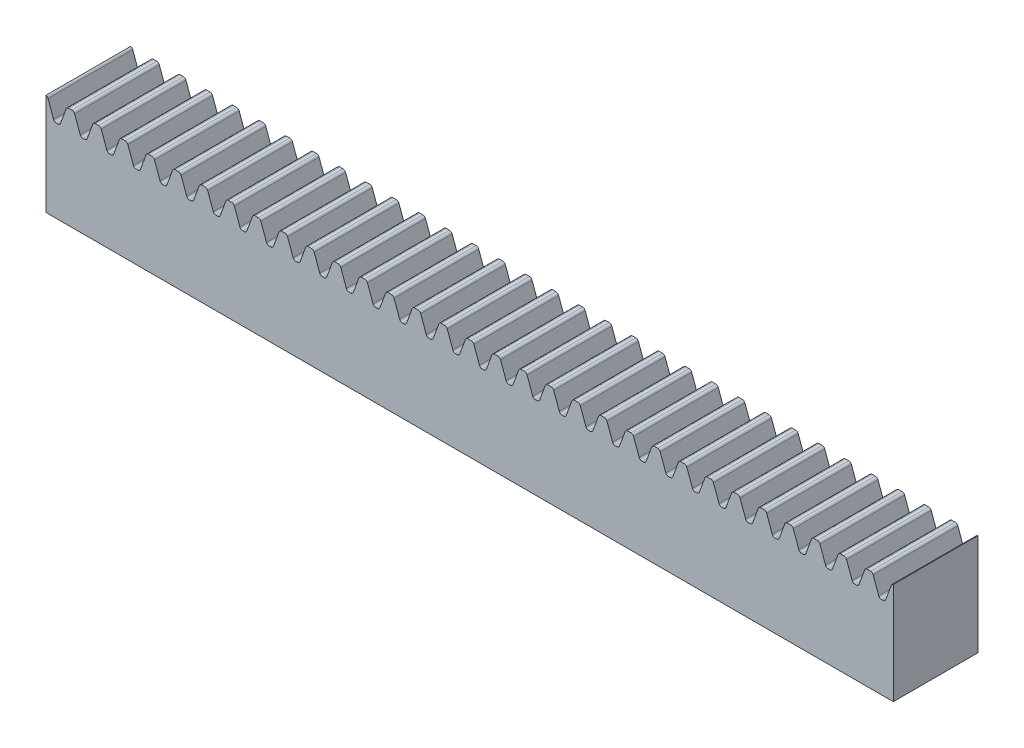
from build123d import *

# Parameters (mm, degrees)
BOSS_EXTRUDE1_DEPTH      = 5
BOSS_EXTRUDE1_DEPTH_BACK = 5
SKETCH3_W                = 100
SKETCH3_H                = 12
CUT_EXTRUDE1_DEPTH       = 51.606323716
LPATTERN1_COUNT          = 32
LPATTERN1_PITCH          = 3.141592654
LPATTERN1_COL_COUNT      = 2
LPATTERN1_COL_PITCH      = 3.141592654


with BuildPart() as part:
    # Sketch3 → Boss-Extrude1 (new, two sides: drawn at the far end of the back side and taken through both)
    with BuildSketch(Plane.XY.offset(-BOSS_EXTRUDE1_DEPTH_BACK)):
        Rectangle(SKETCH3_W, SKETCH3_H)
    extrude(amount=BOSS_EXTRUDE1_DEPTH + BOSS_EXTRUDE1_DEPTH_BACK)

    # Sketch4 → Cut-Extrude1 (cut, symmetric)
    with BuildSketch(Plane.XY):
        with BuildLine():
            Line((-47.625666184, 5.779244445), (-47.545317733, 6))
            Line((-47.545317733, 6), (-48.694686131, 6))
            Line((-48.694686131, 6), (-48.694686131, 3.75))
            Line((-48.694686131, 3.75), (-48.599173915, 3.75))
            ThreePointArc((-48.599173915, 3.75), (-48.406736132, 3.8106754), (-48.283902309, 3.970755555))
            Line((-48.283902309, 3.970755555), (-47.625666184, 5.779244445))
        make_face()
        with BuildLine():
            Line((-47.310394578, 6), (-47.545317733, 6))
            Line((-47.545317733, 6), (-47.625666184, 5.779244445))
            ThreePointArc((-47.625666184, 5.779244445), (-47.502832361, 5.9393246), (-47.310394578, 6))
        make_face()
        with BuildLine():
            Line((-46.622113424, 5.779244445), (-46.702461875, 6))
            Line((-46.702461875, 6), (-46.93738503, 6))
            ThreePointArc((-46.93738503, 6), (-46.744947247, 5.9393246), (-46.622113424, 5.779244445))
        make_face()
        with BuildLine():
            Line((-45.553093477, 3.75), (-45.553093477, 6))
            Line((-45.553093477, 6), (-46.702461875, 6))
            Line((-46.702461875, 6), (-46.622113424, 5.779244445))
            Line((-46.622113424, 5.779244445), (-45.963877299, 3.970755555))
            ThreePointArc((-45.963877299, 3.970755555), (-45.841043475, 3.8106754), (-45.648605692, 3.75))
            Line((-45.648605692, 3.75), (-45.553093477, 3.75))
        make_face()
    cut_extrude1 = extrude(amount=CUT_EXTRUDE1_DEPTH, both=True, mode=Mode.SUBTRACT)

    # LPattern1: Cut-Extrude1 ×32
    with Locations(*[(i * LPATTERN1_PITCH, 0, 0) for i in range(1, LPATTERN1_COUNT)]):
        add(cut_extrude1, mode=Mode.SUBTRACT)

    # LPattern1 col: Cut-Extrude1 ×2
    with Locations(*[(-i * LPATTERN1_COL_PITCH, 0, 0) for i in range(1, LPATTERN1_COL_COUNT)]):
        add(cut_extrude1, mode=Mode.SUBTRACT)


solid = part.part
